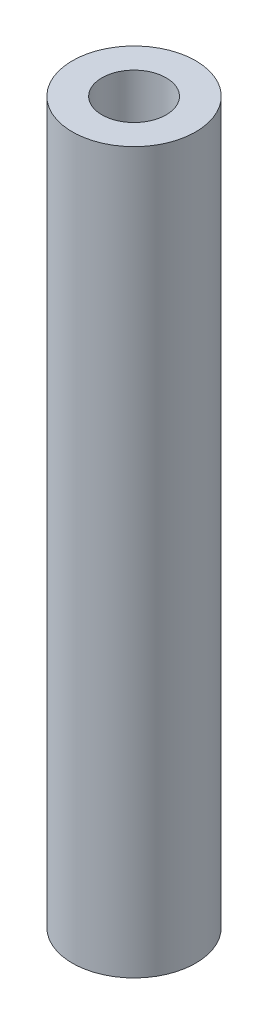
from build123d import *

# Parameters (mm, degrees)
SKETCH1_R           = 4.7625
SKETCH1_R_2         = 2.48125
BOSS_EXTRUDE1_DEPTH = 55.59


with BuildPart() as part:
    # Sketch1 → Boss-Extrude1 (new body)
    with BuildSketch(Plane(origin=(0, 0, 0), x_dir=(1, 0, 0), z_dir=(0, 1, 0))):
        with Locations(Location((0, 0, 0), (0, 0, 90))):
            Circle(SKETCH1_R)
        with Locations(Location((0, 0, 0), (0, 0, 90))):
            Circle(SKETCH1_R_2, mode=Mode.SUBTRACT)
    extrude(amount=BOSS_EXTRUDE1_DEPTH)


solid = part.part
